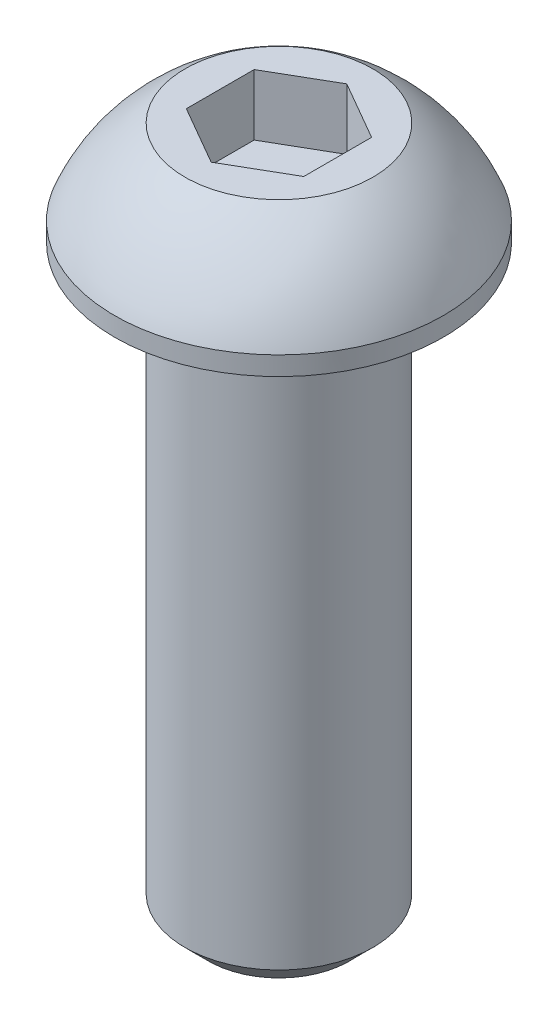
from build123d import *

# Parameters (mm, degrees)
ESQUISSE2_W             = 4
ESQUISSE2_H             = 25
ENL_V_MAT_EXTRU_1_DEPTH = 2.6
CHANFREIN1_SIZE         = 1


with BuildPart() as part:
    # Esquisse1 → Base-R_volution (revolve)
    with BuildSketch(Plane.XY, mode=Mode.PRIVATE) as base_r_volution_sk:
        with BuildLine():
            Line((0, 0), (7, 0))
            Line((7, 0), (7, 0.8))
            ThreePointArc((7, 0.8), (5.787054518, 2.839212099), (4, 4.4))
            Line((4, 4.4), (0, 4.4))
            Line((0, 4.4), (0, 0))
        make_face()
    revolve(base_r_volution_sk.sketch.rotate(Axis((0, 0, 0), (0, 1, 0)), 90), axis=Axis((0, 0, 0), (0, 1, 0)))

    # Esquisse2 → Boss.-R_vol.1 (revolve)
    with BuildSketch(Plane.XY, mode=Mode.PRIVATE) as boss_r_vol_1_sk:
        with Locations((2, -12.5)):
            Rectangle(ESQUISSE2_W, ESQUISSE2_H)
    revolve(boss_r_vol_1_sk.sketch.rotate(Axis((0, 0, 0), (0, 1, 0)), 90), axis=Axis((0, 0, 0), (0, 1, 0)))

    # Esquisse3 → Enl_v. mat.-Extru.1 (cut)
    with BuildSketch(Plane(origin=(0, 4.4, 0), x_dir=(-1, 0, 0), z_dir=(0, 1, 0))):
        Polygon((2.5, 1.443375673), (0, 2.886751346), (-2.5, 1.443375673), (-2.5, -1.443375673), (0, -2.886751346), (2.5, -1.443375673), align=None)
    extrude(amount=-ENL_V_MAT_EXTRU_1_DEPTH, mode=Mode.SUBTRACT)

    # Chanfrein1
    chanfrein1_edges = [part.edges().sort_by_distance(p)[0] for p in [
        (0, -25, 4),
    ]]
    chamfer(chanfrein1_edges, length=CHANFREIN1_SIZE)


solid = part.part
